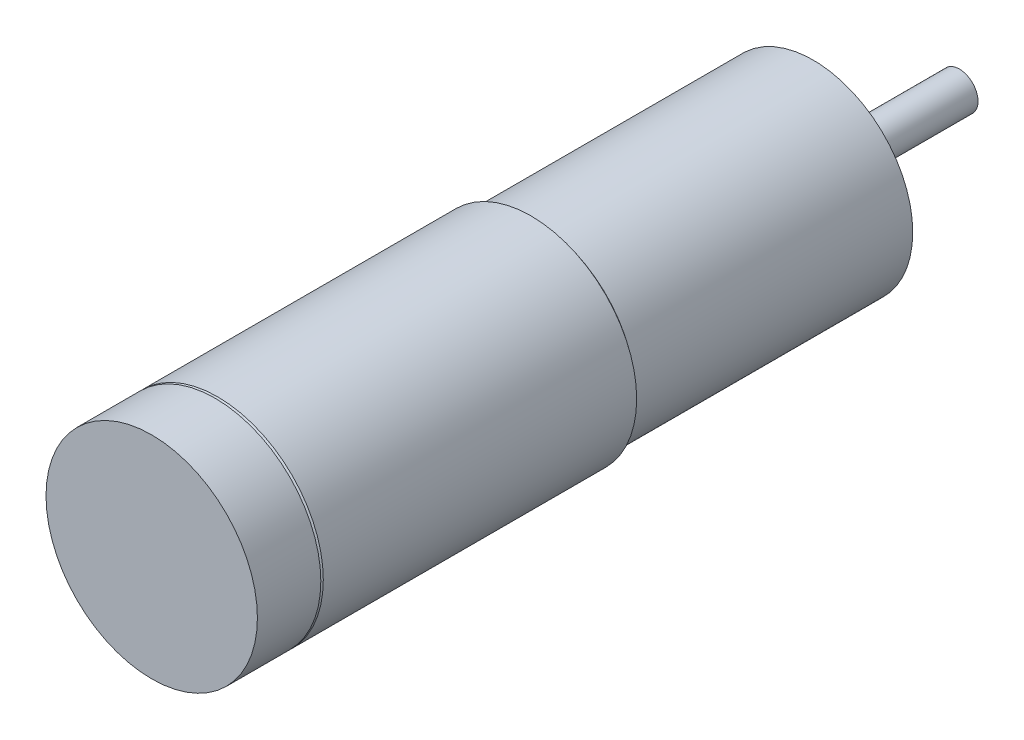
from build123d import *

# Parameters (mm, degrees)
SKETCH1_R                 = 8
GP16A_110323_DEPTH        = 22.7
CHAMFER1_SIZE             = 0.381
SKETCH2_R                 = 8.5
REMAX17_215992_DEPTH      = 25.4
SKETCH3_R                 = 3
EXTRUDE3_DEPTH            = 2.6
SKETCH5_R                 = 1.5
EXTRUDE4_DEPTH            = 11.75
CHAMFER2_SIZE             = 0.2
SKETCH6_R                 = 8.5
MR_201935_DEPTH           = 5.1
M2X0_4_TAPPED_HOLE1_D     = 1.6
M2X0_4_TAPPED_HOLE1_DEPTH = 5.2
M2X0_4_TAPPED_HOLE1_TIP   = 0.480688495


with BuildPart() as part:
    # Sketch1 → GP16A-110323 (new body)
    with BuildSketch(Plane.XY):
        Circle(SKETCH1_R)
    extrude(amount=GP16A_110323_DEPTH)

    # Chamfer1
    chamfer1_edges = [part.edges().sort_by_distance(p)[0] for p in [
        (-8, 0, 22.7),
    ]]
    chamfer(chamfer1_edges, length=CHAMFER1_SIZE)

    # Sketch2 → REmax17-215992 (add)
    with BuildSketch(Plane.XY.offset(22.7)):
        Circle(SKETCH2_R)
    extrude(amount=REMAX17_215992_DEPTH)

    # Sketch3 → Extrude3 (add)
    with BuildSketch(Plane(origin=(0, 0, 0), x_dir=(-1, 0, 0), z_dir=(0, 0, -1))):
        with Locations(Location((0, 0, 0), (0, 0, 180))):
            Circle(SKETCH3_R)
    extrude(amount=EXTRUDE3_DEPTH)

    # Sketch5 → Extrude4 (add)
    with BuildSketch(Plane(origin=(0, 0, 0), x_dir=(-1, 0, 0), z_dir=(0, 0, -1))):
        Circle(SKETCH5_R)
    extrude(amount=EXTRUDE4_DEPTH)

    # Chamfer2
    chamfer2_edges = [part.edges().sort_by_distance(p)[0] for p in [
        (-8.5, 0, 48.1),
    ]]
    chamfer(chamfer2_edges, length=CHAMFER2_SIZE)

    # Sketch6 → MR-201935 (add)
    with BuildSketch(Plane.XY.offset(48.1)):
        Circle(SKETCH6_R)
    extrude(amount=MR_201935_DEPTH)

    # M2x0.4 Tapped Hole1
    with Locations(Plane(origin=(0, 0, 0), x_dir=(-1, 0, 0), z_dir=(0, 0, -1))):
        with Locations((0, 5), (0, -5)):
            Hole(M2X0_4_TAPPED_HOLE1_D / 2, depth=M2X0_4_TAPPED_HOLE1_DEPTH)
            with Locations((0, 0, -(M2X0_4_TAPPED_HOLE1_DEPTH + M2X0_4_TAPPED_HOLE1_TIP / 2))):  # 118° drill point
                Cone(0, M2X0_4_TAPPED_HOLE1_D / 2, M2X0_4_TAPPED_HOLE1_TIP, mode=Mode.SUBTRACT)


solid = part.part
